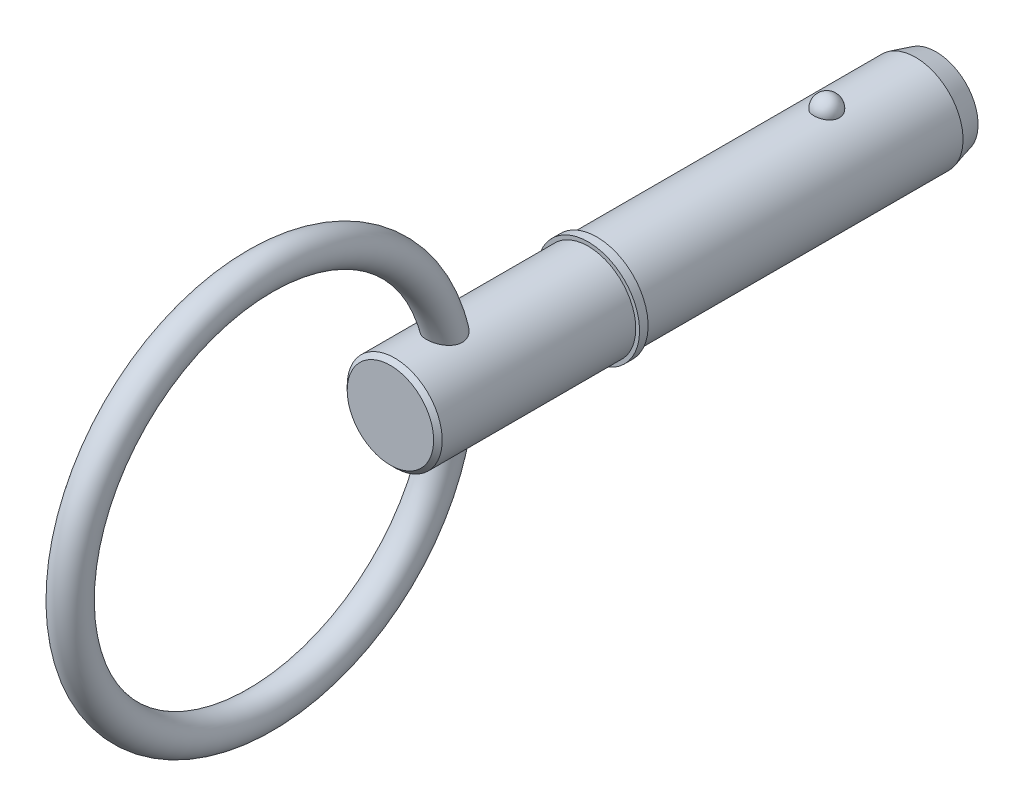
ISO-10303-21;
HEADER;
FILE_DESCRIPTION(('STEP AP214'),'2;1');
FILE_NAME('part.step','',(''),(''),'','','');
FILE_SCHEMA(('AUTOMOTIVE_DESIGN { 1 0 10303 214 1 1 1 1 }'));
ENDSEC;
DATA;
#1=APPLICATION_CONTEXT('core data for automotive mechanical design processes');
#2=APPLICATION_PROTOCOL_DEFINITION('international standard','automotive_design',2000,#1);
#3=PRODUCT_CONTEXT('',#1,'mechanical');
#4=PRODUCT('Part','Part','',(#3));
#5=PRODUCT_RELATED_PRODUCT_CATEGORY('part','',(#4));
#6=PRODUCT_DEFINITION_FORMATION('','',#4);
#7=PRODUCT_DEFINITION_CONTEXT('part definition',#1,'design');
#8=PRODUCT_DEFINITION('design','',#6,#7);
#9=PRODUCT_DEFINITION_SHAPE('','',#8);
#10=(LENGTH_UNIT() NAMED_UNIT(*) SI_UNIT(.MILLI.,.METRE.));
#11=(NAMED_UNIT(*) PLANE_ANGLE_UNIT() SI_UNIT($,.RADIAN.));
#12=(NAMED_UNIT(*) SI_UNIT($,.STERADIAN.) SOLID_ANGLE_UNIT());
#13=UNCERTAINTY_MEASURE_WITH_UNIT(LENGTH_MEASURE(1.E-05),#10,'distance_accuracy_value','');
#14=(GEOMETRIC_REPRESENTATION_CONTEXT(3) GLOBAL_UNCERTAINTY_ASSIGNED_CONTEXT((#13)) GLOBAL_UNIT_ASSIGNED_CONTEXT((#10,
#11,#12)) REPRESENTATION_CONTEXT('',''));
#15=CARTESIAN_POINT('',(0.,0.,0.));
#16=DIRECTION('',(0.,0.,1.));
#17=DIRECTION('',(1.,0.,0.));
#18=AXIS2_PLACEMENT_3D('',#15,#16,#17);
#19=CARTESIAN_POINT('',(0.,0.,25.4));
#20=DIRECTION('',(0.,0.,-1.));
#21=DIRECTION('',(-1.,0.,0.));
#22=AXIS2_PLACEMENT_3D('',#19,#20,#21);
#23=CYLINDRICAL_SURFACE('',#22,5.555);
#24=CARTESIAN_POINT('',(1.47653932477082,5.35517101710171,-1.49));
#25=CARTESIAN_POINT('',(1.4765376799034,5.35517235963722,-1.40667872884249));
#26=CARTESIAN_POINT('',(1.4697233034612,5.35706459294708,-1.32333626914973));
#27=CARTESIAN_POINT('',(1.4426291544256,5.36442332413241,-1.15900769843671));
#28=CARTESIAN_POINT('',(1.42234344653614,5.36989139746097,-1.07802264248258));
#29=CARTESIAN_POINT('',(1.36882802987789,5.38378061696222,-0.920757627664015));
#30=CARTESIAN_POINT('',(1.33560404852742,5.39220045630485,-0.84447560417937));
#31=CARTESIAN_POINT('',(1.25704906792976,5.41105136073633,-0.698703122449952));
#32=CARTESIAN_POINT('',(1.21171855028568,5.42148234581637,-0.629212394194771));
#33=CARTESIAN_POINT('',(1.10986325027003,5.44324765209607,-0.498626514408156));
#34=CARTESIAN_POINT('',(1.05328868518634,5.45458585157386,-0.437570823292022));
#35=CARTESIAN_POINT('',(0.930545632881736,5.4768596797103,-0.325918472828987));
#36=CARTESIAN_POINT('',(0.864377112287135,5.48779530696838,-0.275321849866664));
#37=CARTESIAN_POINT('',(0.724412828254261,5.50801510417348,-0.1861255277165));
#38=CARTESIAN_POINT('',(0.650637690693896,5.51730356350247,-0.147494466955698));
#39=CARTESIAN_POINT('',(0.497383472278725,5.53322345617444,-0.083158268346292));
#40=CARTESIAN_POINT('',(0.417904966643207,5.53985515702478,-0.0574518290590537));
#41=CARTESIAN_POINT('',(0.256903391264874,5.54963245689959,-0.0200294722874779));
#42=CARTESIAN_POINT('',(0.17543580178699,5.55283384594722,-0.00808940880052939));
#43=CARTESIAN_POINT('',(0.011588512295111,5.55559187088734,0.00221439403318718));
#44=CARTESIAN_POINT('',(-0.0707911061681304,5.55514883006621,0.000579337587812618));
#45=CARTESIAN_POINT('',(-0.232980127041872,5.55069756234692,-0.0161051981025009));
#46=CARTESIAN_POINT('',(-0.312809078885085,5.54673626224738,-0.0309781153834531));
#47=CARTESIAN_POINT('',(-0.468771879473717,5.5357377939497,-0.0734743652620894));
#48=CARTESIAN_POINT('',(-0.544905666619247,5.52870057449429,-0.101097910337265));
#49=CARTESIAN_POINT('',(-0.691800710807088,5.51225307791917,-0.168516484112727));
#50=CARTESIAN_POINT('',(-0.762530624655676,5.50283015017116,-0.208376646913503));
#51=CARTESIAN_POINT('',(-0.896294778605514,5.48263289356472,-0.299136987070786));
#52=CARTESIAN_POINT('',(-0.959328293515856,5.47185843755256,-0.350038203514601));
#53=CARTESIAN_POINT('',(-1.07712789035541,5.44990641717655,-0.4625172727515));
#54=CARTESIAN_POINT('',(-1.13172901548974,5.43872509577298,-0.524267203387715));
#55=CARTESIAN_POINT('',(-1.2299173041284,5.41736658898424,-0.656133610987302));
#56=CARTESIAN_POINT('',(-1.2735037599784,5.40718946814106,-0.726250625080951));
#57=CARTESIAN_POINT('',(-1.34896420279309,5.38886361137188,-0.87371320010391));
#58=CARTESIAN_POINT('',(-1.38071142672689,5.38073711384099,-0.951126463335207));
#59=CARTESIAN_POINT('',(-1.4310375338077,5.36757288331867,-1.11037033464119));
#60=CARTESIAN_POINT('',(-1.44961676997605,5.3625350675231,-1.1922008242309));
#61=CARTESIAN_POINT('',(-1.47308754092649,5.35613553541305,-1.35761209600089));
#62=CARTESIAN_POINT('',(-1.47803294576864,5.35475935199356,-1.44118467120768));
#63=CARTESIAN_POINT('',(-1.47426441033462,5.35579807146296,-1.60799588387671));
#64=CARTESIAN_POINT('',(-1.46555080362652,5.35821288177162,-1.69123452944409));
#65=CARTESIAN_POINT('',(-1.43475662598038,5.36653964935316,-1.85462882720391));
#66=CARTESIAN_POINT('',(-1.41273621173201,5.37243586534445,-1.93479663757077));
#67=CARTESIAN_POINT('',(-1.35593151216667,5.38705199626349,-2.0902011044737));
#68=CARTESIAN_POINT('',(-1.32114675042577,5.39577201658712,-2.16543757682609));
#69=CARTESIAN_POINT('',(-1.23947506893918,5.41511674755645,-2.30926926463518));
#70=CARTESIAN_POINT('',(-1.1925277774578,5.42575087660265,-2.37782893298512));
#71=CARTESIAN_POINT('',(-1.08780725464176,5.44771095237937,-2.50598876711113));
#72=CARTESIAN_POINT('',(-1.03003365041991,5.4590369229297,-2.56558862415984));
#73=CARTESIAN_POINT('',(-0.90495349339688,5.48116073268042,-2.67436535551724));
#74=CARTESIAN_POINT('',(-0.837616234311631,5.49195671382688,-2.7235073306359));
#75=CARTESIAN_POINT('',(-0.69537970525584,5.51177099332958,-2.8097317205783));
#76=CARTESIAN_POINT('',(-0.620480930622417,5.52078940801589,-2.84681492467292));
#77=CARTESIAN_POINT('',(-0.466144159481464,5.53594369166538,-2.90749751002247));
#78=CARTESIAN_POINT('',(-0.386768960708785,5.54211181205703,-2.93124844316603));
#79=CARTESIAN_POINT('',(-0.224991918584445,5.5510324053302,-2.96523308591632));
#80=CARTESIAN_POINT('',(-0.142590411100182,5.55378525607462,-2.97546829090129));
#81=CARTESIAN_POINT('',(0.0213711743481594,5.55555351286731,-2.98206550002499));
#82=CARTESIAN_POINT('',(0.102921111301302,5.55463281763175,-2.97866468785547));
#83=CARTESIAN_POINT('',(0.2642564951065,5.54929804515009,-2.95862186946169));
#84=CARTESIAN_POINT('',(0.344041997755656,5.54488407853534,-2.94198028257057));
#85=CARTESIAN_POINT('',(0.499344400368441,5.53305794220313,-2.89600357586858));
#86=CARTESIAN_POINT('',(0.574874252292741,5.52565550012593,-2.86670961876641));
#87=CARTESIAN_POINT('',(0.71989857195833,5.50863937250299,-2.79624249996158));
#88=CARTESIAN_POINT('',(0.78939269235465,5.49902555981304,-2.75506865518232));
#89=CARTESIAN_POINT('',(0.921480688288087,5.47845199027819,-2.66127110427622));
#90=CARTESIAN_POINT('',(0.983960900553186,5.46747485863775,-2.60849118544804));
#91=CARTESIAN_POINT('',(1.09925057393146,5.44546837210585,-2.49325304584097));
#92=CARTESIAN_POINT('',(1.15205830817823,5.43443900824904,-2.43079310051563));
#93=CARTESIAN_POINT('',(1.24742943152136,5.41335152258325,-2.29680711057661));
#94=CARTESIAN_POINT('',(1.28981661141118,5.40331162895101,-2.22515272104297));
#95=CARTESIAN_POINT('',(1.36214937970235,5.38553336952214,-2.07558035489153));
#96=CARTESIAN_POINT('',(1.39210034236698,5.37779400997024,-1.99766510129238));
#97=CARTESIAN_POINT('',(1.43569518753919,5.36630594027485,-1.84848338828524));
#98=CARTESIAN_POINT('',(1.45098536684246,5.36216169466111,-1.77772322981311));
#99=CARTESIAN_POINT('',(1.47140805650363,5.35659367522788,-1.63464735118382));
#100=CARTESIAN_POINT('',(1.47654075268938,5.35516985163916,-1.56233165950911));
#101=CARTESIAN_POINT('',(1.47653932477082,5.35517101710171,-1.49));
#102=B_SPLINE_CURVE_WITH_KNOTS('',3,(#24,#25,#26,#27,#28,#29,#30,#31,#32,#33,#34,#35,#36,#37,
#38,#39,#40,#41,#42,#43,#44,#45,#46,#47,#48,#49,#50,#51,#52,#53,#54,#55,#56,#57,#58,#59,#60,#61,
#62,#63,#64,#65,#66,#67,#68,#69,#70,#71,#72,#73,#74,#75,#76,#77,#78,#79,#80,#81,#82,#83,#84,#85,
#86,#87,#88,#89,#90,#91,#92,#93,#94,#95,#96,#97,#98,#99,#100,#101),.UNSPECIFIED.,.T.,.F.,(4,2,2,
2,2,2,2,2,2,2,2,2,2,2,2,2,2,2,2,2,2,2,2,2,2,2,2,2,2,2,2,2,2,2,2,2,2,2,4),(0.,0.249703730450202,
0.4995175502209,0.749220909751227,0.998914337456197,1.24973894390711,1.50056442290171,
1.75072681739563,2.00086401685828,2.24686822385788,2.49285060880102,2.73560052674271,
2.97835449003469,3.22242369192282,3.46651587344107,3.71490232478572,3.96330473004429,
4.21429522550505,4.46527899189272,4.71526963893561,4.96525418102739,5.21411697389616,
5.46298905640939,5.71312097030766,5.96326150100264,6.21422412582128,6.46517032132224,
6.71320296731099,6.96120816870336,7.20491846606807,7.44862104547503,7.69153667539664,
7.93446627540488,8.18089104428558,8.42735976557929,8.67774679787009,8.92802551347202,
9.14479867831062,9.36156787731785),.UNSPECIFIED.);
#103=CARTESIAN_POINT('',(1.47653932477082,5.35517101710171,-1.49));
#104=VERTEX_POINT('',#103);
#105=EDGE_CURVE('E103',#104,#104,#102,.T.);
#106=ORIENTED_EDGE('',*,*,#105,.T.);
#107=EDGE_LOOP('',(#106));
#108=FACE_BOUND('',#107,.T.);
#109=CARTESIAN_POINT('',(0.,0.,-11.87));
#110=DIRECTION('',(0.,0.,-1.));
#111=DIRECTION('',(-1.,0.,0.));
#112=AXIS2_PLACEMENT_3D('',#109,#110,#111);
#113=CIRCLE('',#112,5.555);
#114=CARTESIAN_POINT('',(-5.555,0.,-11.87));
#115=VERTEX_POINT('',#114);
#116=EDGE_CURVE('E110',#115,#115,#113,.F.);
#117=ORIENTED_EDGE('',*,*,#116,.T.);
#118=EDGE_LOOP('',(#117));
#119=FACE_BOUND('',#118,.T.);
#120=CARTESIAN_POINT('',(0.,0.,25.4));
#121=DIRECTION('',(0.,0.,1.));
#122=DIRECTION('',(1.,0.,0.));
#123=AXIS2_PLACEMENT_3D('',#120,#121,#122);
#124=CIRCLE('',#123,5.555);
#125=CARTESIAN_POINT('',(5.555,0.,25.4));
#126=VERTEX_POINT('',#125);
#127=EDGE_CURVE('E108',#126,#126,#124,.T.);
#128=ORIENTED_EDGE('',*,*,#127,.F.);
#129=EDGE_LOOP('',(#128));
#130=FACE_BOUND('',#129,.T.);
#131=ADVANCED_FACE('F39',(#108,#119,#130),#23,.T.);
#132=CARTESIAN_POINT('',(0.,0.,-14.27));
#133=DIRECTION('',(0.,0.,-1.));
#134=DIRECTION('',(-1.,0.,0.));
#135=AXIS2_PLACEMENT_3D('',#132,#133,#134);
#136=PLANE('',#135);
#137=CARTESIAN_POINT('',(0.,0.,-14.27));
#138=DIRECTION('',(0.,0.,-1.));
#139=DIRECTION('',(-1.,0.,0.));
#140=AXIS2_PLACEMENT_3D('',#137,#138,#139);
#141=CIRCLE('',#140,4.9119219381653);
#142=CARTESIAN_POINT('',(-4.9119219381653,0.,-14.27));
#143=VERTEX_POINT('',#142);
#144=EDGE_CURVE('E143',#143,#143,#141,.T.);
#145=ORIENTED_EDGE('',*,*,#144,.T.);
#146=EDGE_LOOP('',(#145));
#147=FACE_BOUND('',#146,.T.);
#148=ADVANCED_FACE('F89',(#147),#136,.T.);
#149=CARTESIAN_POINT('',(0.,0.,-14.27));
#150=DIRECTION('',(0.,0.,1.));
#151=DIRECTION('',(1.,0.,0.));
#152=AXIS2_PLACEMENT_3D('',#149,#150,#151);
#153=CONICAL_SURFACE('',#152,4.91192193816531,0.261799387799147);
#154=ORIENTED_EDGE('',*,*,#116,.F.);
#155=EDGE_LOOP('',(#154));
#156=FACE_BOUND('',#155,.T.);
#157=ORIENTED_EDGE('',*,*,#144,.F.);
#158=EDGE_LOOP('',(#157));
#159=FACE_BOUND('',#158,.T.);
#160=ADVANCED_FACE('F95',(#156,#159),#153,.T.);
#161=CARTESIAN_POINT('',(0.,5.555,-1.49));
#162=DIRECTION('',(0.,1.,0.));
#163=DIRECTION('',(0.,0.,1.));
#164=AXIS2_PLACEMENT_3D('',#161,#162,#163);
#165=SPHERICAL_SURFACE('',#164,1.49);
#166=ORIENTED_EDGE('',*,*,#105,.F.);
#167=EDGE_LOOP('',(#166));
#168=FACE_BOUND('',#167,.T.);
#169=ADVANCED_FACE('F113',(#168),#165,.T.);
#170=CARTESIAN_POINT('',(0.,0.,25.4));
#171=DIRECTION('',(0.,0.,-1.));
#172=DIRECTION('',(-1.,0.,0.));
#173=AXIS2_PLACEMENT_3D('',#170,#171,#172);
#174=PLANE('',#173);
#175=ORIENTED_EDGE('',*,*,#127,.T.);
#176=EDGE_LOOP('',(#175));
#177=FACE_BOUND('',#176,.T.);
#178=CARTESIAN_POINT('',(0.,0.,25.4));
#179=DIRECTION('',(0.,0.,-1.));
#180=DIRECTION('',(-1.,0.,0.));
#181=AXIS2_PLACEMENT_3D('',#178,#179,#180);
#182=CIRCLE('',#181,6.);
#183=CARTESIAN_POINT('',(-6.,0.,25.4));
#184=VERTEX_POINT('',#183);
#185=EDGE_CURVE('E109',#184,#184,#182,.T.);
#186=ORIENTED_EDGE('',*,*,#185,.T.);
#187=EDGE_LOOP('',(#186));
#188=FACE_BOUND('',#187,.T.);
#189=ADVANCED_FACE('F117',(#177,#188),#174,.T.);
#190=CARTESIAN_POINT('',(0.,0.,33.7287874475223));
#191=DIRECTION('',(0.,0.,-1.));
#192=DIRECTION('',(-1.,0.,0.));
#193=AXIS2_PLACEMENT_3D('',#190,#191,#192);
#194=CYLINDRICAL_SURFACE('',#193,6.);
#195=CARTESIAN_POINT('',(0.,0.,26.4));
#196=DIRECTION('',(0.,0.,-1.));
#197=DIRECTION('',(-1.,0.,0.));
#198=AXIS2_PLACEMENT_3D('',#195,#196,#197);
#199=CIRCLE('',#198,6.);
#200=CARTESIAN_POINT('',(-6.,0.,26.4));
#201=VERTEX_POINT('',#200);
#202=EDGE_CURVE('E134',#201,#201,#199,.T.);
#203=ORIENTED_EDGE('',*,*,#202,.T.);
#204=EDGE_LOOP('',(#203));
#205=FACE_BOUND('',#204,.T.);
#206=ORIENTED_EDGE('',*,*,#185,.F.);
#207=EDGE_LOOP('',(#206));
#208=FACE_BOUND('',#207,.T.);
#209=ADVANCED_FACE('F121',(#205,#208),#194,.T.);
#210=CARTESIAN_POINT('',(0.,6.,26.4));
#211=DIRECTION('',(0.,0.,1.));
#212=DIRECTION('',(1.,0.,0.));
#213=AXIS2_PLACEMENT_3D('',#210,#211,#212);
#214=PLANE('',#213);
#215=CARTESIAN_POINT('',(0.,0.,26.4));
#216=DIRECTION('',(0.,0.,1.));
#217=DIRECTION('',(1.,0.,0.));
#218=AXIS2_PLACEMENT_3D('',#215,#216,#217);
#219=CIRCLE('',#218,5.555);
#220=CARTESIAN_POINT('',(5.555,0.,26.4));
#221=VERTEX_POINT('',#220);
#222=EDGE_CURVE('E112',#221,#221,#219,.T.);
#223=ORIENTED_EDGE('',*,*,#222,.F.);
#224=EDGE_LOOP('',(#223));
#225=FACE_BOUND('',#224,.T.);
#226=ORIENTED_EDGE('',*,*,#202,.F.);
#227=EDGE_LOOP('',(#226));
#228=FACE_BOUND('',#227,.T.);
#229=ADVANCED_FACE('F86',(#225,#228),#214,.T.);
#230=CARTESIAN_POINT('',(0.,0.,49.53));
#231=DIRECTION('',(0.,0.,-1.));
#232=DIRECTION('',(-1.,0.,0.));
#233=AXIS2_PLACEMENT_3D('',#230,#231,#232);
#234=CYLINDRICAL_SURFACE('',#233,5.555);
#235=CARTESIAN_POINT('',(-0.961380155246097,-5.47117658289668,41.4087332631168));
#236=CARTESIAN_POINT('',(-0.863231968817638,-5.48842171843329,41.3575155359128));
#237=CARTESIAN_POINT('',(-0.760548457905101,-5.50372118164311,41.3143181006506));
#238=CARTESIAN_POINT('',(-0.548956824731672,-5.52883500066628,41.2449127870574));
#239=CARTESIAN_POINT('',(-0.440048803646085,-5.53864944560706,41.2187046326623));
#240=CARTESIAN_POINT('',(-0.219033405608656,-5.55178384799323,41.1838646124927));
#241=CARTESIAN_POINT('',(-0.106925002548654,-5.55510169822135,41.1752384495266));
#242=CARTESIAN_POINT('',(0.117238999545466,-5.55489351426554,41.1757834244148));
#243=CARTESIAN_POINT('',(0.229294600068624,-5.55136768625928,41.1849540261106));
#244=CARTESIAN_POINT('',(0.449588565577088,-5.5378711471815,41.2207847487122));
#245=CARTESIAN_POINT('',(0.557843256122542,-5.52793284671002,41.247356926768));
#246=CARTESIAN_POINT('',(0.768116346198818,-5.50265785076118,41.3173095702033));
#247=CARTESIAN_POINT('',(0.870134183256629,-5.48732066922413,41.3606915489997));
#248=CARTESIAN_POINT('',(1.06580880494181,-5.45270790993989,41.4636854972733));
#249=CARTESIAN_POINT('',(1.1594033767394,-5.43340601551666,41.5234068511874));
#250=CARTESIAN_POINT('',(1.33484934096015,-5.39298781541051,41.6576727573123));
#251=CARTESIAN_POINT('',(1.41670019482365,-5.37187142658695,41.7322179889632));
#252=CARTESIAN_POINT('',(1.56628651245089,-5.33017932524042,41.8944337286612));
#253=CARTESIAN_POINT('',(1.63402728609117,-5.30960341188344,41.9820992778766));
#254=CARTESIAN_POINT('',(1.7533832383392,-5.27139606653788,42.16835593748));
#255=CARTESIAN_POINT('',(1.80500413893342,-5.25376359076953,42.2669431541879));
#256=CARTESIAN_POINT('',(1.88923054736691,-5.22405733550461,42.4688661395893));
#257=CARTESIAN_POINT('',(1.92240068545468,-5.21182119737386,42.5719426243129));
#258=CARTESIAN_POINT('',(1.97156802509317,-5.19342304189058,42.7826121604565));
#259=CARTESIAN_POINT('',(1.98756752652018,-5.18726021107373,42.8902046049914));
#260=CARTESIAN_POINT('',(2.00238957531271,-5.1815556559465,43.1048133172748));
#261=CARTESIAN_POINT('',(2.0015062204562,-5.18190056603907,43.2118070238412));
#262=CARTESIAN_POINT('',(1.98404322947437,-5.18861029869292,43.4242949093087));
#263=CARTESIAN_POINT('',(1.96745884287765,-5.19497694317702,43.52978862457));
#264=CARTESIAN_POINT('',(1.91810947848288,-5.21340722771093,43.7437346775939));
#265=CARTESIAN_POINT('',(1.88435438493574,-5.22581720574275,43.8519270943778));
#266=CARTESIAN_POINT('',(1.80161540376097,-5.25491400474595,44.0617187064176));
#267=CARTESIAN_POINT('',(1.75262312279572,-5.27160318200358,44.1633142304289));
#268=CARTESIAN_POINT('',(1.63431251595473,-5.30955034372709,44.3688565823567));
#269=CARTESIAN_POINT('',(1.56333412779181,-5.33111051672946,44.4717964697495));
#270=CARTESIAN_POINT('',(1.4052960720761,-5.37493145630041,44.6644716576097));
#271=CARTESIAN_POINT('',(1.31822569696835,-5.39719268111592,44.7541980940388));
#272=CARTESIAN_POINT('',(1.1272889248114,-5.44031451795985,44.9190042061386));
#273=CARTESIAN_POINT('',(1.02309899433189,-5.46113424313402,44.993723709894));
#274=CARTESIAN_POINT('',(0.801576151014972,-5.49800171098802,45.1218052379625));
#275=CARTESIAN_POINT('',(0.684264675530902,-5.51405708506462,45.175201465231));
#276=CARTESIAN_POINT('',(0.456877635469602,-5.53719478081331,45.250980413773));
#277=CARTESIAN_POINT('',(0.347974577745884,-5.54519800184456,45.2765844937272));
#278=CARTESIAN_POINT('',(0.127042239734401,-5.55464249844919,45.3067313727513));
#279=CARTESIAN_POINT('',(0.0150164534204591,-5.55609083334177,45.311296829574));
#280=CARTESIAN_POINT('',(-0.191993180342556,-5.55250986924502,45.2999113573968));
#281=CARTESIAN_POINT('',(-0.287160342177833,-5.54836194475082,45.2867524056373));
#282=CARTESIAN_POINT('',(-0.473863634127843,-5.53554271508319,45.2454897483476));
#283=CARTESIAN_POINT('',(-0.565399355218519,-5.52687090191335,45.2173843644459));
#284=CARTESIAN_POINT('',(-0.743786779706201,-5.50572322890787,45.147293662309));
#285=CARTESIAN_POINT('',(-0.830566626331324,-5.49320168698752,45.1051411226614));
#286=CARTESIAN_POINT('',(-0.996720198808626,-5.46549909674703,45.008875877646));
#287=CARTESIAN_POINT('',(-1.07609119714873,-5.45031707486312,44.9547587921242));
#288=CARTESIAN_POINT('',(-1.23672272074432,-5.41628785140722,44.8282113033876));
#289=CARTESIAN_POINT('',(-1.3167603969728,-5.39722327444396,44.7542891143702));
#290=CARTESIAN_POINT('',(-1.46504263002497,-5.3588760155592,44.595462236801));
#291=CARTESIAN_POINT('',(-1.53327828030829,-5.33959318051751,44.5105493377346));
#292=CARTESIAN_POINT('',(-1.66602271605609,-5.29979878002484,44.3186972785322));
#293=CARTESIAN_POINT('',(-1.72857256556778,-5.27951148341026,44.2103478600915));
#294=CARTESIAN_POINT('',(-1.83559571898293,-5.24326402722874,43.9843258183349));
#295=CARTESIAN_POINT('',(-1.88006296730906,-5.22730531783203,43.8666500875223));
#296=CARTESIAN_POINT('',(-1.94988009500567,-5.20167534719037,43.6220877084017));
#297=CARTESIAN_POINT('',(-1.97477410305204,-5.19215470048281,43.4950527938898));
#298=CARTESIAN_POINT('',(-2.00168294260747,-5.18184594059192,43.2382494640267));
#299=CARTESIAN_POINT('',(-2.0037221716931,-5.18104851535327,43.1084841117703));
#300=CARTESIAN_POINT('',(-1.98467753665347,-5.18836681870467,42.864652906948));
#301=CARTESIAN_POINT('',(-1.96600067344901,-5.19555485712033,42.7503700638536));
#302=CARTESIAN_POINT('',(-1.9092354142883,-5.21668050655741,42.527389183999));
#303=CARTESIAN_POINT('',(-1.87115335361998,-5.23061591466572,42.4186893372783));
#304=CARTESIAN_POINT('',(-1.78015350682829,-5.26224244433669,42.2183712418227));
#305=CARTESIAN_POINT('',(-1.72857344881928,-5.27957041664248,42.1260829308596));
#306=CARTESIAN_POINT('',(-1.61106729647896,-5.31660340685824,41.9516847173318));
#307=CARTESIAN_POINT('',(-1.54514024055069,-5.33630858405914,41.8695754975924));
#308=CARTESIAN_POINT('',(-1.39929408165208,-5.37641320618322,41.7158871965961));
#309=CARTESIAN_POINT('',(-1.31912544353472,-5.39681868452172,41.6445467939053));
#310=CARTESIAN_POINT('',(-1.14786008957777,-5.43582099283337,41.5158557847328));
#311=CARTESIAN_POINT('',(-1.05676174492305,-5.4544175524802,41.4585072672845));
#312=CARTESIAN_POINT('',(-0.961380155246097,-5.47117658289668,41.4087332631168));
#313=B_SPLINE_CURVE_WITH_KNOTS('',3,(#235,#236,#237,#238,#239,#240,#241,#242,#243,#244,#245,
#246,#247,#248,#249,#250,#251,#252,#253,#254,#255,#256,#257,#258,#259,#260,#261,#262,#263,#264,
#265,#266,#267,#268,#269,#270,#271,#272,#273,#274,#275,#276,#277,#278,#279,#280,#281,#282,#283,
#284,#285,#286,#287,#288,#289,#290,#291,#292,#293,#294,#295,#296,#297,#298,#299,#300,#301,#302,
#303,#304,#305,#306,#307,#308,#309,#310,#311,#312),.UNSPECIFIED.,.T.,.F.,(4,2,2,2,2,2,2,2,2,2,2,
2,2,2,2,2,2,2,2,2,2,2,2,2,2,2,2,2,2,2,2,2,2,2,2,2,2,2,4),(0.,0.335747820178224,
0.671490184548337,1.00734143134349,1.3431825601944,1.6773394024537,2.01152633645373,
2.3480076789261,2.68450444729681,3.02087435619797,3.35712472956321,3.68242216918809,
4.00767603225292,4.32726924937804,4.64695919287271,4.98762165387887,5.32847210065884,
5.70742878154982,6.08663853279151,6.47407889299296,6.86089527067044,7.19531213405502,
7.52936875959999,7.81649827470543,8.10366003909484,8.39437023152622,8.68518702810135,
9.01572837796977,9.34651809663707,9.72504519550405,10.1036989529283,10.4909301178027,
10.8777478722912,11.2239231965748,11.5699855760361,11.8899109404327,12.2098577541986,
12.5360928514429,12.8623766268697),.UNSPECIFIED.);
#314=CARTESIAN_POINT('',(-0.961380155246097,-5.47117658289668,41.4087332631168));
#315=VERTEX_POINT('',#314);
#316=EDGE_CURVE('E10',#315,#315,#313,.T.);
#317=ORIENTED_EDGE('',*,*,#316,.F.);
#318=EDGE_LOOP('',(#317));
#319=FACE_BOUND('',#318,.T.);
#320=CARTESIAN_POINT('',(-0.961380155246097,5.47117658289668,41.4087332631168));
#321=CARTESIAN_POINT('',(-1.05891474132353,5.45403910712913,41.4596311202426));
#322=CARTESIAN_POINT('',(-1.15197270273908,5.43497920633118,41.5184510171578));
#323=CARTESIAN_POINT('',(-1.32661268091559,5.39501222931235,41.6507016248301));
#324=CARTESIAN_POINT('',(-1.40819495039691,5.37410519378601,41.7241320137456));
#325=CARTESIAN_POINT('',(-1.55769110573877,5.33269731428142,41.884098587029));
#326=CARTESIAN_POINT('',(-1.62558729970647,5.3121970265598,41.9706514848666));
#327=CARTESIAN_POINT('',(-1.74556031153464,5.27399510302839,42.1546466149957));
#328=CARTESIAN_POINT('',(-1.7976419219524,5.25629262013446,42.2520855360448));
#329=CARTESIAN_POINT('',(-1.88339939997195,5.22617061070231,42.4525656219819));
#330=CARTESIAN_POINT('',(-1.91750373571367,5.21362983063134,42.5554052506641));
#331=CARTESIAN_POINT('',(-1.96852412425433,5.194582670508,42.7657781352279));
#332=CARTESIAN_POINT('',(-1.98544249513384,5.18807547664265,42.8733107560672));
#333=CARTESIAN_POINT('',(-2.00201964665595,5.18170011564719,43.0878197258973));
#334=CARTESIAN_POINT('',(-2.00199605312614,5.18170977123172,43.194768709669));
#335=CARTESIAN_POINT('',(-1.98621575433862,5.18777751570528,43.4073062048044));
#336=CARTESIAN_POINT('',(-1.97045441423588,5.19383738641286,43.5128943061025));
#337=CARTESIAN_POINT('',(-1.92280904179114,5.21167084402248,43.7269141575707));
#338=CARTESIAN_POINT('',(-1.88996782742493,5.22378174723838,43.8351030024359));
#339=CARTESIAN_POINT('',(-1.80906901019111,5.252344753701,44.0450298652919));
#340=CARTESIAN_POINT('',(-1.76100319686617,5.26879919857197,44.146764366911));
#341=CARTESIAN_POINT('',(-1.64464870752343,5.30634509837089,44.3527880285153));
#342=CARTESIAN_POINT('',(-1.57469702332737,5.32774959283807,44.4560850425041));
#343=CARTESIAN_POINT('',(-1.41872356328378,5.37138743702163,44.6496881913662));
#344=CARTESIAN_POINT('',(-1.3326906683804,5.39362135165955,44.7399852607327));
#345=CARTESIAN_POINT('',(-1.14345202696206,5.43692909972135,44.9065572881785));
#346=CARTESIAN_POINT('',(-1.03986000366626,5.45795811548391,44.9824096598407));
#347=CARTESIAN_POINT('',(-0.819338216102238,5.49537389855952,45.1129167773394));
#348=CARTESIAN_POINT('',(-0.702429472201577,5.51176784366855,45.1676043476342));
#349=CARTESIAN_POINT('',(-0.475167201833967,5.53565843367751,45.2460220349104));
#350=CARTESIAN_POINT('',(-0.36599730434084,5.54404610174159,45.2728937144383));
#351=CARTESIAN_POINT('',(-0.144272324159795,5.55422966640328,45.3054265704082));
#352=CARTESIAN_POINT('',(-0.0317212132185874,5.55603301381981,45.3111117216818));
#353=CARTESIAN_POINT('',(0.176166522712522,5.55303883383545,45.3015929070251));
#354=CARTESIAN_POINT('',(0.271662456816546,5.54914868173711,45.2892608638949));
#355=CARTESIAN_POINT('',(0.459140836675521,5.53678955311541,45.2495233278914));
#356=CARTESIAN_POINT('',(0.551122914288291,5.52832009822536,45.222116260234));
#357=CARTESIAN_POINT('',(0.730082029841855,5.50755841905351,45.1534371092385));
#358=CARTESIAN_POINT('',(0.817013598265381,5.49523641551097,45.1120568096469));
#359=CARTESIAN_POINT('',(0.983569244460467,5.46788364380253,45.0172936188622));
#360=CARTESIAN_POINT('',(1.06319070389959,5.45285191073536,44.9639064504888));
#361=CARTESIAN_POINT('',(1.22430017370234,5.4191117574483,44.8389828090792));
#362=CARTESIAN_POINT('',(1.30459540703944,5.40018081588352,44.7659703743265));
#363=CARTESIAN_POINT('',(1.45353150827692,5.3620139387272,44.6089433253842));
#364=CARTESIAN_POINT('',(1.52216366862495,5.3427777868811,44.5249205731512));
#365=CARTESIAN_POINT('',(1.65601602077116,5.30294271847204,44.3348114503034));
#366=CARTESIAN_POINT('',(1.71927851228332,5.28255425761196,44.2272944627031));
#367=CARTESIAN_POINT('',(1.82790996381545,5.24595721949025,44.0028474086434));
#368=CARTESIAN_POINT('',(1.8732722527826,5.22975020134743,43.8859138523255));
#369=CARTESIAN_POINT('',(1.94526503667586,5.20341207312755,43.6421941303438));
#370=CARTESIAN_POINT('',(1.97135787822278,5.1934564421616,43.5152273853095));
#371=CARTESIAN_POINT('',(2.00068973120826,5.18223330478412,43.258318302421));
#372=CARTESIAN_POINT('',(2.00395290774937,5.18095661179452,43.1283792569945));
#373=CARTESIAN_POINT('',(1.98717985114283,5.1874070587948,42.883763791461));
#374=CARTESIAN_POINT('',(1.96951989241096,5.19421607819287,42.7688994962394));
#375=CARTESIAN_POINT('',(1.91463360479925,5.2146960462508,42.5445890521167));
#376=CARTESIAN_POINT('',(1.87741409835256,5.22836460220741,42.4351410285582));
#377=CARTESIAN_POINT('',(1.78800305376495,5.25957304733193,42.2335428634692));
#378=CARTESIAN_POINT('',(1.73720600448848,5.27672774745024,42.1407093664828));
#379=CARTESIAN_POINT('',(1.62116201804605,5.3135255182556,41.9651218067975));
#380=CARTESIAN_POINT('',(1.55591428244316,5.33316872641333,41.8823683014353));
#381=CARTESIAN_POINT('',(1.41164041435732,5.37317145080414,41.7276485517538));
#382=CARTESIAN_POINT('',(1.33241957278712,5.39353732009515,41.6558657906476));
#383=CARTESIAN_POINT('',(1.16300716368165,5.43258596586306,41.5261126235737));
#384=CARTESIAN_POINT('',(1.07281393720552,5.45126848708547,41.4681443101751));
#385=CARTESIAN_POINT('',(0.880638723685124,5.48564753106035,41.3655070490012));
#386=CARTESIAN_POINT('',(0.778364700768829,5.50122427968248,41.3213437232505));
#387=CARTESIAN_POINT('',(0.567418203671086,5.52696543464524,41.2499735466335));
#388=CARTESIAN_POINT('',(0.45874576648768,5.53712987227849,41.2227665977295));
#389=CARTESIAN_POINT('',(0.237791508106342,5.55101406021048,41.1858797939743));
#390=CARTESIAN_POINT('',(0.125501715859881,5.55471842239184,41.1762417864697));
#391=CARTESIAN_POINT('',(-0.0992056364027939,5.55525045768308,41.1748490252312));
#392=CARTESIAN_POINT('',(-0.211623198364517,5.55207802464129,41.1830945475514));
#393=CARTESIAN_POINT('',(-0.434217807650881,5.53913427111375,41.217408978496));
#394=CARTESIAN_POINT('',(-0.544370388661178,5.5293114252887,41.2436170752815));
#395=CARTESIAN_POINT('',(-0.758352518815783,5.50404767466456,41.3133955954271));
#396=CARTESIAN_POINT('',(-0.862181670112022,5.48860641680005,41.3569671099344));
#397=CARTESIAN_POINT('',(-0.961380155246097,5.47117658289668,41.4087332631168));
#398=B_SPLINE_CURVE_WITH_KNOTS('',3,(#320,#321,#322,#323,#324,#325,#326,#327,#328,#329,#330,
#331,#332,#333,#334,#335,#336,#337,#338,#339,#340,#341,#342,#343,#344,#345,#346,#347,#348,#349,
#350,#351,#352,#353,#354,#355,#356,#357,#358,#359,#360,#361,#362,#363,#364,#365,#366,#367,#368,
#369,#370,#371,#372,#373,#374,#375,#376,#377,#378,#379,#380,#381,#382,#383,#384,#385,#386,#387,
#388,#389,#390,#391,#392,#393,#394,#395,#396,#397),.UNSPECIFIED.,.T.,.F.,(4,2,2,2,2,2,2,2,2,2,2,
2,2,2,2,2,2,2,2,2,2,2,2,2,2,2,2,2,2,2,2,2,2,2,2,2,2,2,4),(0.,0.333636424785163,
0.667265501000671,1.00132312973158,1.33527942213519,1.6608682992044,1.98641325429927,
2.30585509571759,2.62539104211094,2.96514840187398,3.30508930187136,3.68313901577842,
4.06145109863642,4.44953802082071,4.83702062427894,5.17316628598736,5.508931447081,
5.79666415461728,6.08442692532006,6.37447144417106,6.66461944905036,6.99384361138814,
7.32331250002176,7.70083591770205,8.0784998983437,8.46633986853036,8.85376924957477,
9.20110411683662,9.54831791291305,9.86844524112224,10.1885902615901,10.513611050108,
10.8386810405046,11.1745469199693,11.5104108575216,11.8470737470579,12.183741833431,
12.5230486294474,12.8623767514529),.UNSPECIFIED.);
#399=CARTESIAN_POINT('',(-0.961380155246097,5.47117658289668,41.4087332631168));
#400=VERTEX_POINT('',#399);
#401=EDGE_CURVE('E51',#400,#400,#398,.T.);
#402=ORIENTED_EDGE('',*,*,#401,.F.);
#403=EDGE_LOOP('',(#402));
#404=FACE_BOUND('',#403,.T.);
#405=CARTESIAN_POINT('',(0.,0.,49.03));
#406=DIRECTION('',(0.,0.,-1.));
#407=DIRECTION('',(-1.,0.,0.));
#408=AXIS2_PLACEMENT_3D('',#405,#406,#407);
#409=CIRCLE('',#408,5.555);
#410=CARTESIAN_POINT('',(-5.555,0.,49.03));
#411=VERTEX_POINT('',#410);
#412=EDGE_CURVE('E65',#411,#411,#409,.T.);
#413=ORIENTED_EDGE('',*,*,#412,.T.);
#414=EDGE_LOOP('',(#413));
#415=FACE_BOUND('',#414,.T.);
#416=ORIENTED_EDGE('',*,*,#222,.T.);
#417=EDGE_LOOP('',(#416));
#418=FACE_BOUND('',#417,.T.);
#419=ADVANCED_FACE('F70',(#319,#404,#415,#418),#234,.T.);
#420=CARTESIAN_POINT('',(0.,0.,49.53));
#421=DIRECTION('',(0.,0.,-1.));
#422=DIRECTION('',(-1.,0.,0.));
#423=AXIS2_PLACEMENT_3D('',#420,#421,#422);
#424=PLANE('',#423);
#425=CARTESIAN_POINT('',(0.,0.,49.53));
#426=DIRECTION('',(0.,0.,-1.));
#427=DIRECTION('',(-1.,0.,0.));
#428=AXIS2_PLACEMENT_3D('',#425,#426,#427);
#429=CIRCLE('',#428,5.05499999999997);
#430=CARTESIAN_POINT('',(-5.05499999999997,0.,49.53));
#431=VERTEX_POINT('',#430);
#432=EDGE_CURVE('E58',#431,#431,#429,.F.);
#433=ORIENTED_EDGE('',*,*,#432,.T.);
#434=EDGE_LOOP('',(#433));
#435=FACE_BOUND('',#434,.T.);
#436=ADVANCED_FACE('F77',(#435),#424,.F.);
#437=CARTESIAN_POINT('',(0.,0.,49.03));
#438=DIRECTION('',(0.,0.,-1.));
#439=DIRECTION('',(-1.,0.,0.));
#440=AXIS2_PLACEMENT_3D('',#437,#438,#439);
#441=CONICAL_SURFACE('',#440,5.555,0.785398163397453);
#442=ORIENTED_EDGE('',*,*,#432,.F.);
#443=EDGE_LOOP('',(#442));
#444=FACE_BOUND('',#443,.T.);
#445=ORIENTED_EDGE('',*,*,#412,.F.);
#446=EDGE_LOOP('',(#445));
#447=FACE_BOUND('',#446,.T.);
#448=ADVANCED_FACE('F41',(#444,#447),#441,.T.);
#449=CARTESIAN_POINT('',(0.,0.,64.755));
#450=DIRECTION('',(1.,0.,0.));
#451=DIRECTION('',(0.,0.,-1.));
#452=AXIS2_PLACEMENT_3D('',#449,#450,#451);
#453=TOROIDAL_SURFACE('',#452,22.225,2.);
#454=ORIENTED_EDGE('',*,*,#316,.T.);
#455=EDGE_LOOP('',(#454));
#456=FACE_BOUND('',#455,.T.);
#457=ORIENTED_EDGE('',*,*,#401,.T.);
#458=EDGE_LOOP('',(#457));
#459=FACE_BOUND('',#458,.T.);
#460=ADVANCED_FACE('F74',(#456,#459),#453,.T.);
#461=CLOSED_SHELL('',(#131,#148,#160,#169,#189,#209,#229,#419,#436,#448,#460));
#462=MANIFOLD_SOLID_BREP('B2',#461);
#463=ADVANCED_BREP_SHAPE_REPRESENTATION('',(#18,#462),#14);
#464=SHAPE_DEFINITION_REPRESENTATION(#9,#463);
ENDSEC;
END-ISO-10303-21;
